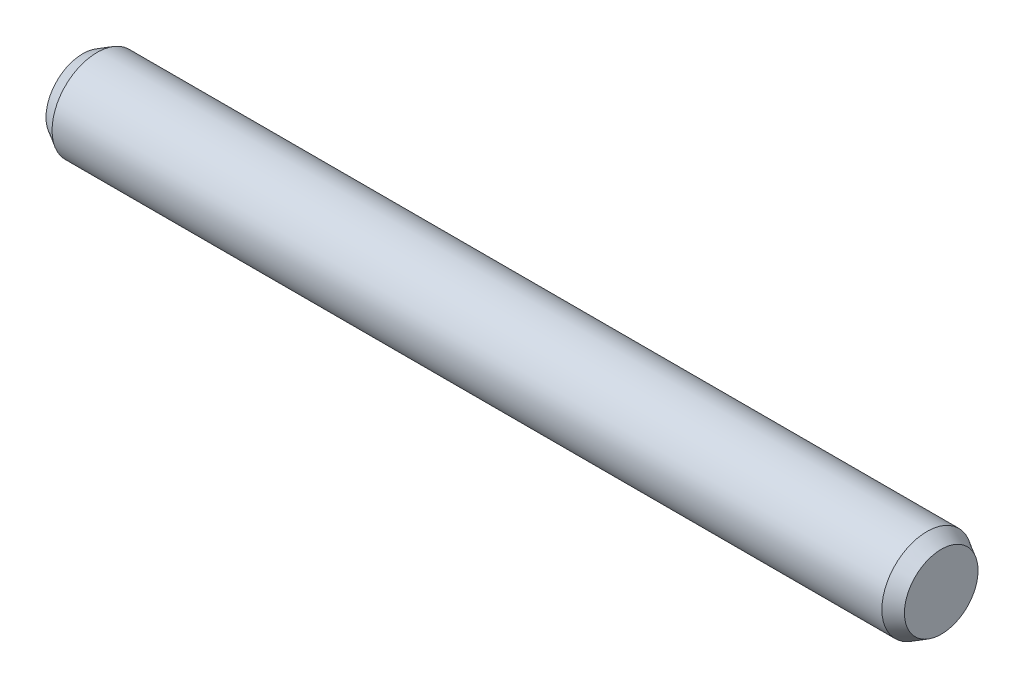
ISO-10303-21;
HEADER;
FILE_DESCRIPTION(('STEP AP214'),'2;1');
FILE_NAME('part.step','',(''),(''),'','','');
FILE_SCHEMA(('AUTOMOTIVE_DESIGN { 1 0 10303 214 1 1 1 1 }'));
ENDSEC;
DATA;
#1=APPLICATION_CONTEXT('core data for automotive mechanical design processes');
#2=APPLICATION_PROTOCOL_DEFINITION('international standard','automotive_design',2000,#1);
#3=PRODUCT_CONTEXT('',#1,'mechanical');
#4=PRODUCT('Part','Part','',(#3));
#5=PRODUCT_RELATED_PRODUCT_CATEGORY('part','',(#4));
#6=PRODUCT_DEFINITION_FORMATION('','',#4);
#7=PRODUCT_DEFINITION_CONTEXT('part definition',#1,'design');
#8=PRODUCT_DEFINITION('design','',#6,#7);
#9=PRODUCT_DEFINITION_SHAPE('','',#8);
#10=(LENGTH_UNIT() NAMED_UNIT(*) SI_UNIT(.MILLI.,.METRE.));
#11=(NAMED_UNIT(*) PLANE_ANGLE_UNIT() SI_UNIT($,.RADIAN.));
#12=(NAMED_UNIT(*) SI_UNIT($,.STERADIAN.) SOLID_ANGLE_UNIT());
#13=UNCERTAINTY_MEASURE_WITH_UNIT(LENGTH_MEASURE(1.E-05),#10,'distance_accuracy_value','');
#14=(GEOMETRIC_REPRESENTATION_CONTEXT(3) GLOBAL_UNCERTAINTY_ASSIGNED_CONTEXT((#13)) GLOBAL_UNIT_ASSIGNED_CONTEXT((#10,
#11,#12)) REPRESENTATION_CONTEXT('',''));
#15=CARTESIAN_POINT('',(0.,0.,0.));
#16=DIRECTION('',(0.,0.,1.));
#17=DIRECTION('',(1.,0.,0.));
#18=AXIS2_PLACEMENT_3D('',#15,#16,#17);
#19=CARTESIAN_POINT('',(0.,0.,0.));
#20=DIRECTION('',(1.,0.,0.));
#21=DIRECTION('',(0.,0.,-1.));
#22=AXIS2_PLACEMENT_3D('',#19,#20,#21);
#23=PLANE('',#22);
#24=CARTESIAN_POINT('',(0.,0.,0.));
#25=DIRECTION('',(-1.,0.,0.));
#26=DIRECTION('',(0.,0.,1.));
#27=AXIS2_PLACEMENT_3D('',#24,#25,#26);
#28=CIRCLE('',#27,0.653453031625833);
#29=CARTESIAN_POINT('',(0.,0.,0.653453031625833));
#30=VERTEX_POINT('',#29);
#31=EDGE_CURVE('E10',#30,#30,#28,.T.);
#32=ORIENTED_EDGE('',*,*,#31,.T.);
#33=EDGE_LOOP('',(#32));
#34=FACE_BOUND('',#33,.T.);
#35=ADVANCED_FACE('F30',(#34),#23,.F.);
#36=CARTESIAN_POINT('',(0.254,0.,0.));
#37=DIRECTION('',(1.,0.,0.));
#38=DIRECTION('',(0.,0.,-1.));
#39=AXIS2_PLACEMENT_3D('',#36,#37,#38);
#40=CONICAL_SURFACE('',#39,0.800099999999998,0.523598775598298);
#41=ORIENTED_EDGE('',*,*,#31,.F.);
#42=EDGE_LOOP('',(#41));
#43=FACE_BOUND('',#42,.T.);
#44=CARTESIAN_POINT('',(0.254,0.,0.));
#45=DIRECTION('',(-1.,0.,0.));
#46=DIRECTION('',(0.,0.,1.));
#47=AXIS2_PLACEMENT_3D('',#44,#45,#46);
#48=CIRCLE('',#47,0.800099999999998);
#49=CARTESIAN_POINT('',(0.254,0.,0.800099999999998));
#50=VERTEX_POINT('',#49);
#51=EDGE_CURVE('E36',#50,#50,#48,.T.);
#52=ORIENTED_EDGE('',*,*,#51,.T.);
#53=EDGE_LOOP('',(#52));
#54=FACE_BOUND('',#53,.T.);
#55=ADVANCED_FACE('F62',(#43,#54),#40,.T.);
#56=CARTESIAN_POINT('',(0.,0.,0.));
#57=DIRECTION('',(-1.,0.,0.));
#58=DIRECTION('',(0.,0.,1.));
#59=AXIS2_PLACEMENT_3D('',#56,#57,#58);
#60=CYLINDRICAL_SURFACE('',#59,0.800099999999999);
#61=ORIENTED_EDGE('',*,*,#51,.F.);
#62=EDGE_LOOP('',(#61));
#63=FACE_BOUND('',#62,.T.);
#64=CARTESIAN_POINT('',(14.986,0.,0.));
#65=DIRECTION('',(-1.,0.,0.));
#66=DIRECTION('',(0.,0.,1.));
#67=AXIS2_PLACEMENT_3D('',#64,#65,#66);
#68=CIRCLE('',#67,0.8001);
#69=CARTESIAN_POINT('',(14.986,0.,0.8001));
#70=VERTEX_POINT('',#69);
#71=EDGE_CURVE('E40',#70,#70,#68,.T.);
#72=ORIENTED_EDGE('',*,*,#71,.T.);
#73=EDGE_LOOP('',(#72));
#74=FACE_BOUND('',#73,.T.);
#75=ADVANCED_FACE('F58',(#63,#74),#60,.T.);
#76=CARTESIAN_POINT('',(15.24,0.,0.));
#77=DIRECTION('',(-1.,0.,0.));
#78=DIRECTION('',(0.,0.,1.));
#79=AXIS2_PLACEMENT_3D('',#76,#77,#78);
#80=CONICAL_SURFACE('',#79,0.653453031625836,0.523598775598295);
#81=ORIENTED_EDGE('',*,*,#71,.F.);
#82=EDGE_LOOP('',(#81));
#83=FACE_BOUND('',#82,.T.);
#84=CARTESIAN_POINT('',(15.24,0.,0.));
#85=DIRECTION('',(-1.,0.,0.));
#86=DIRECTION('',(0.,0.,1.));
#87=AXIS2_PLACEMENT_3D('',#84,#85,#86);
#88=CIRCLE('',#87,0.653453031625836);
#89=CARTESIAN_POINT('',(15.24,0.,0.653453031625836));
#90=VERTEX_POINT('',#89);
#91=EDGE_CURVE('E44',#90,#90,#88,.T.);
#92=ORIENTED_EDGE('',*,*,#91,.T.);
#93=EDGE_LOOP('',(#92));
#94=FACE_BOUND('',#93,.T.);
#95=ADVANCED_FACE('F50',(#83,#94),#80,.T.);
#96=CARTESIAN_POINT('',(15.24,0.653453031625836,0.));
#97=DIRECTION('',(-1.,0.,0.));
#98=DIRECTION('',(0.,0.,1.));
#99=AXIS2_PLACEMENT_3D('',#96,#97,#98);
#100=PLANE('',#99);
#101=ORIENTED_EDGE('',*,*,#91,.F.);
#102=EDGE_LOOP('',(#101));
#103=FACE_BOUND('',#102,.T.);
#104=ADVANCED_FACE('F52',(#103),#100,.F.);
#105=CLOSED_SHELL('',(#35,#55,#75,#95,#104));
#106=MANIFOLD_SOLID_BREP('B2',#105);
#107=ADVANCED_BREP_SHAPE_REPRESENTATION('',(#18,#106),#14);
#108=SHAPE_DEFINITION_REPRESENTATION(#9,#107);
ENDSEC;
END-ISO-10303-21;
